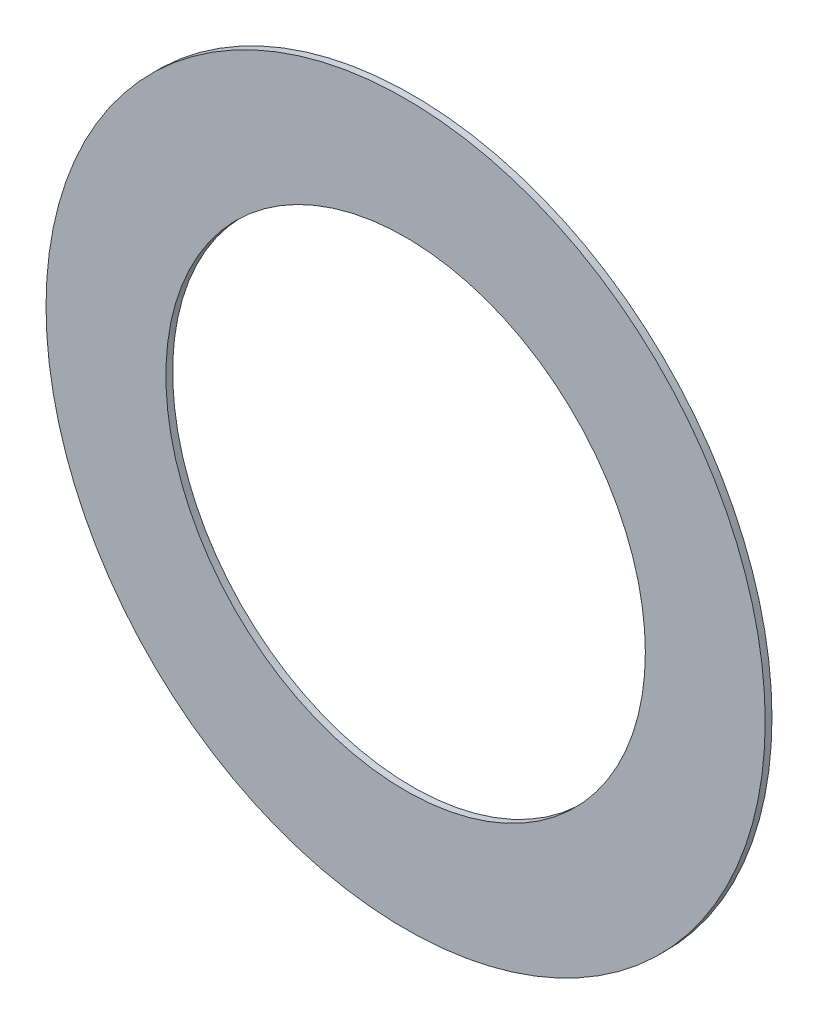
ISO-10303-21;
HEADER;
FILE_DESCRIPTION(('STEP AP214'),'2;1');
FILE_NAME('part.step','',(''),(''),'','','');
FILE_SCHEMA(('AUTOMOTIVE_DESIGN { 1 0 10303 214 1 1 1 1 }'));
ENDSEC;
DATA;
#1=APPLICATION_CONTEXT('core data for automotive mechanical design processes');
#2=APPLICATION_PROTOCOL_DEFINITION('international standard','automotive_design',2000,#1);
#3=PRODUCT_CONTEXT('',#1,'mechanical');
#4=PRODUCT('Part','Part','',(#3));
#5=PRODUCT_RELATED_PRODUCT_CATEGORY('part','',(#4));
#6=PRODUCT_DEFINITION_FORMATION('','',#4);
#7=PRODUCT_DEFINITION_CONTEXT('part definition',#1,'design');
#8=PRODUCT_DEFINITION('design','',#6,#7);
#9=PRODUCT_DEFINITION_SHAPE('','',#8);
#10=(LENGTH_UNIT() NAMED_UNIT(*) SI_UNIT(.MILLI.,.METRE.));
#11=(NAMED_UNIT(*) PLANE_ANGLE_UNIT() SI_UNIT($,.RADIAN.));
#12=(NAMED_UNIT(*) SI_UNIT($,.STERADIAN.) SOLID_ANGLE_UNIT());
#13=UNCERTAINTY_MEASURE_WITH_UNIT(LENGTH_MEASURE(1.E-05),#10,'distance_accuracy_value','');
#14=(GEOMETRIC_REPRESENTATION_CONTEXT(3) GLOBAL_UNCERTAINTY_ASSIGNED_CONTEXT((#13)) GLOBAL_UNIT_ASSIGNED_CONTEXT((#10,
#11,#12)) REPRESENTATION_CONTEXT('',''));
#15=CARTESIAN_POINT('',(0.,0.,0.));
#16=DIRECTION('',(0.,0.,1.));
#17=DIRECTION('',(1.,0.,0.));
#18=AXIS2_PLACEMENT_3D('',#15,#16,#17);
#19=CARTESIAN_POINT('',(0.,0.,0.127));
#20=DIRECTION('',(0.,0.,1.));
#21=DIRECTION('',(1.,0.,0.));
#22=AXIS2_PLACEMENT_3D('',#19,#20,#21);
#23=PLANE('',#22);
#24=CARTESIAN_POINT('',(0.,0.,0.127));
#25=DIRECTION('',(0.,0.,1.));
#26=DIRECTION('',(1.,0.,0.));
#27=AXIS2_PLACEMENT_3D('',#24,#25,#26);
#28=CIRCLE('',#27,6.75000000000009);
#29=CARTESIAN_POINT('',(6.75000000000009,0.,0.127));
#30=VERTEX_POINT('',#29);
#31=EDGE_CURVE('E10',#30,#30,#28,.T.);
#32=ORIENTED_EDGE('',*,*,#31,.T.);
#33=EDGE_LOOP('',(#32));
#34=FACE_BOUND('',#33,.T.);
#35=CARTESIAN_POINT('',(0.,0.,0.127));
#36=DIRECTION('',(0.,0.,1.));
#37=DIRECTION('',(1.,0.,0.));
#38=AXIS2_PLACEMENT_3D('',#35,#36,#37);
#39=CIRCLE('',#38,4.50000000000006);
#40=CARTESIAN_POINT('',(4.50000000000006,0.,0.127));
#41=VERTEX_POINT('',#40);
#42=EDGE_CURVE('E42',#41,#41,#39,.T.);
#43=ORIENTED_EDGE('',*,*,#42,.F.);
#44=EDGE_LOOP('',(#43));
#45=FACE_BOUND('',#44,.T.);
#46=ADVANCED_FACE('F31',(#34,#45),#23,.T.);
#47=CARTESIAN_POINT('',(0.,0.,0.));
#48=DIRECTION('',(0.,0.,1.));
#49=DIRECTION('',(1.,0.,0.));
#50=AXIS2_PLACEMENT_3D('',#47,#48,#49);
#51=PLANE('',#50);
#52=CARTESIAN_POINT('',(0.,0.,0.));
#53=DIRECTION('',(0.,0.,1.));
#54=DIRECTION('',(1.,0.,0.));
#55=AXIS2_PLACEMENT_3D('',#52,#53,#54);
#56=CIRCLE('',#55,6.75000000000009);
#57=CARTESIAN_POINT('',(6.75000000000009,0.,0.));
#58=VERTEX_POINT('',#57);
#59=EDGE_CURVE('E35',#58,#58,#56,.T.);
#60=ORIENTED_EDGE('',*,*,#59,.F.);
#61=EDGE_LOOP('',(#60));
#62=FACE_BOUND('',#61,.T.);
#63=CARTESIAN_POINT('',(0.,0.,0.));
#64=DIRECTION('',(0.,0.,1.));
#65=DIRECTION('',(1.,0.,0.));
#66=AXIS2_PLACEMENT_3D('',#63,#64,#65);
#67=CIRCLE('',#66,4.50000000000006);
#68=CARTESIAN_POINT('',(4.50000000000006,0.,0.));
#69=VERTEX_POINT('',#68);
#70=EDGE_CURVE('E44',#69,#69,#67,.T.);
#71=ORIENTED_EDGE('',*,*,#70,.T.);
#72=EDGE_LOOP('',(#71));
#73=FACE_BOUND('',#72,.T.);
#74=ADVANCED_FACE('F54',(#62,#73),#51,.F.);
#75=CARTESIAN_POINT('',(0.,0.,0.127));
#76=DIRECTION('',(0.,0.,-1.));
#77=DIRECTION('',(-1.,0.,0.));
#78=AXIS2_PLACEMENT_3D('',#75,#76,#77);
#79=CYLINDRICAL_SURFACE('',#78,6.75000000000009);
#80=ORIENTED_EDGE('',*,*,#31,.F.);
#81=EDGE_LOOP('',(#80));
#82=FACE_BOUND('',#81,.T.);
#83=ORIENTED_EDGE('',*,*,#59,.T.);
#84=EDGE_LOOP('',(#83));
#85=FACE_BOUND('',#84,.T.);
#86=ADVANCED_FACE('F33',(#82,#85),#79,.T.);
#87=CARTESIAN_POINT('',(0.,0.,0.127));
#88=DIRECTION('',(0.,0.,-1.));
#89=DIRECTION('',(-1.,0.,0.));
#90=AXIS2_PLACEMENT_3D('',#87,#88,#89);
#91=CYLINDRICAL_SURFACE('',#90,4.50000000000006);
#92=ORIENTED_EDGE('',*,*,#42,.T.);
#93=EDGE_LOOP('',(#92));
#94=FACE_BOUND('',#93,.T.);
#95=ORIENTED_EDGE('',*,*,#70,.F.);
#96=EDGE_LOOP('',(#95));
#97=FACE_BOUND('',#96,.T.);
#98=ADVANCED_FACE('F50',(#94,#97),#91,.F.);
#99=CLOSED_SHELL('',(#46,#74,#86,#98));
#100=MANIFOLD_SOLID_BREP('B2',#99);
#101=ADVANCED_BREP_SHAPE_REPRESENTATION('',(#18,#100),#14);
#102=SHAPE_DEFINITION_REPRESENTATION(#9,#101);
ENDSEC;
END-ISO-10303-21;
